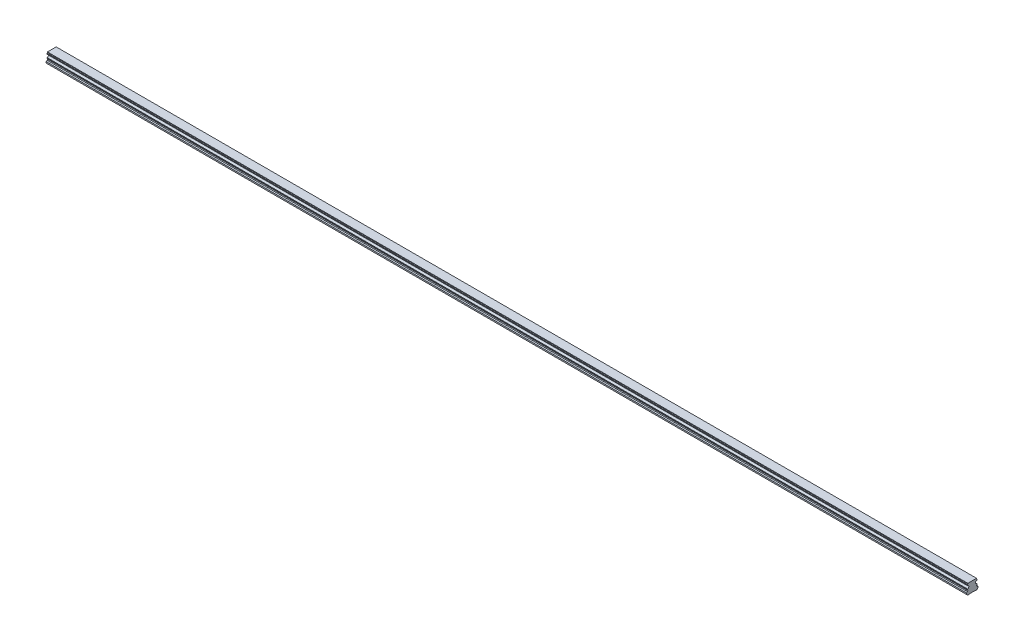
from build123d import *

# Parameters (mm, degrees)
BOSS_EXTRUDE1_DEPTH        = 1980
SKETCH3_R                  = 3
SKETCH3_R_2                = 2.5
CUT_EXTRUDE3_DEPTH         = 12
SKETCH3_2_R                = 2.5
CUT_EXTRUDE4_DEPTH         = 15
CHAMFER1_SIZE              = 0.5
LPATTERN4_COUNT            = 33
LPATTERN4_PITCH            = 60
CHAMFER1_OF_LPATTERN4_SIZE = 0.5


with BuildPart() as part:
    # Sketch1 → Boss-Extrude1 (new body)
    with BuildSketch(Plane(origin=(0, 0, 0), x_dir=(0, 0, -1), z_dir=(1, 0, 0))):
        with BuildLine():
            Line((9.375, 21.8), (-9.375, 21.8))
            Line((-9.375, 21.8), (-9.375, 20.756))
            Line((-9.375, 20.756), (-10, 19.415683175))
            Line((-10, 19.415683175), (-10, 17.685449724))
            ThreePointArc((-10, 17.685449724), (-7.2, 14.6), (-10, 11.514550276))
            Line((-10, 11.514550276), (-10, 9.784316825))
            Line((-10, 9.784316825), (-9.375, 8.444))
            Line((-9.375, 8.444), (-9.922688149, 6.4))
            Line((-9.922688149, 6.4), (-12.5, 5.489338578))
            Line((-12.5, 5.489338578), (-12.5, 2.65))
            Line((-12.5, 2.65), (-9.85, 0))
            Line((-9.85, 0), (-5.5, 0))
            Line((-5.5, 0), (-5, 0.5))
            Line((-5, 0.5), (5, 0.5))
            Line((5, 0.5), (5.5, 0))
            Line((5.5, 0), (9.85, 0))
            Line((9.85, 0), (12.5, 2.65))
            Line((12.5, 2.65), (12.5, 5.489338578))
            Line((12.5, 5.489338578), (9.922688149, 6.4))
            Line((9.922688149, 6.4), (9.375, 8.444))
            Line((9.375, 8.444), (10, 9.784316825))
            Line((10, 9.784316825), (10, 11.514550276))
            ThreePointArc((10, 11.514550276), (7.2, 14.6), (10, 17.685449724))
            Line((10, 17.685449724), (10, 19.415683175))
            Line((10, 19.415683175), (9.375, 20.756))
            Line((9.375, 20.756), (9.375, 21.8))
        make_face()
    extrude(amount=BOSS_EXTRUDE1_DEPTH)

    # Sketch3 → Cut-Extrude3 (cut)
    with BuildSketch(Plane.XZ):
        with Locations(Location((30, 0, 0), (0, 0, 270))):
            Circle(SKETCH3_R)
        with Locations(Location((30, 0, 0), (0, 0, 270))):
            Circle(SKETCH3_R_2, mode=Mode.SUBTRACT)
    cut_extrude3 = extrude(amount=-CUT_EXTRUDE3_DEPTH, mode=Mode.SUBTRACT)

    # Sketch3_2 → Cut-Extrude4 (cut)
    with BuildSketch(Plane.XZ):
        with Locations(Location((30, 0, 0), (0, 0, 270))):
            Circle(SKETCH3_2_R)
    cut_extrude4 = extrude(amount=-CUT_EXTRUDE4_DEPTH, mode=Mode.SUBTRACT)

    # Cut-Extrude5 cone 1 section (on through the dimple's axis) → Cut-Extrude5 (revolve, cut)
    with BuildSketch(Plane(origin=(30, 15, 0), x_dir=(0, 0, -1), z_dir=(1, 0, 0))):
        Polygon((0, 0), (2.5, 0), (0, 1.443375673), align=None)
    cut_extrude5 = revolve(axis=Axis((30, 15, 0), (0, 1, 0)), mode=Mode.SUBTRACT)

    # Chamfer1
    chamfer1_edges = [part.edges().sort_by_distance(p)[0] for p in [
        (30, 0.5, 3),
    ]]
    chamfer(chamfer1_edges, length=CHAMFER1_SIZE)

    # LPattern4: Cut-Extrude3, Cut-Extrude4, Cut-Extrude5 ×33
    with Locations(*[(i * LPATTERN4_PITCH, 0, 0) for i in range(1, LPATTERN4_COUNT)]):
        add(cut_extrude3, mode=Mode.SUBTRACT)
        add(cut_extrude4, mode=Mode.SUBTRACT)
        add(cut_extrude5, mode=Mode.SUBTRACT)

    # Chamfer1 of LPattern4
    chamfer1_of_lpattern4_edges = [part.edges().sort_by_distance(p)[0] for p in [
        (90, 0.5, 3),
        (150, 0.5, 3),
        (210, 0.5, 3),
        (270, 0.5, 3),
        (330, 0.5, 3),
        (390, 0.5, 3),
        (450, 0.5, 3),
        (510, 0.5, 3),
        (570, 0.5, 3),
        (630, 0.5, 3),
        (690, 0.5, 3),
        (750, 0.5, 3),
        (810, 0.5, 3),
        (870, 0.5, 3),
        (930, 0.5, 3),
        (990, 0.5, 3),
        (1050, 0.5, 3),
        (1110, 0.5, 3),
        (1170, 0.5, 3),
        (1230, 0.5, 3),
        (1290, 0.5, 3),
        (1350, 0.5, 3),
        (1410, 0.5, 3),
        (1470, 0.5, 3),
        (1530, 0.5, 3),
        (1590, 0.5, 3),
        (1650, 0.5, 3),
        (1710, 0.5, 3),
        (1770, 0.5, 3),
        (1830, 0.5, 3),
        (1890, 0.5, 3),
        (1950, 0.5, 3),
    ]]
    chamfer(chamfer1_of_lpattern4_edges, length=CHAMFER1_OF_LPATTERN4_SIZE)


solid = part.part
